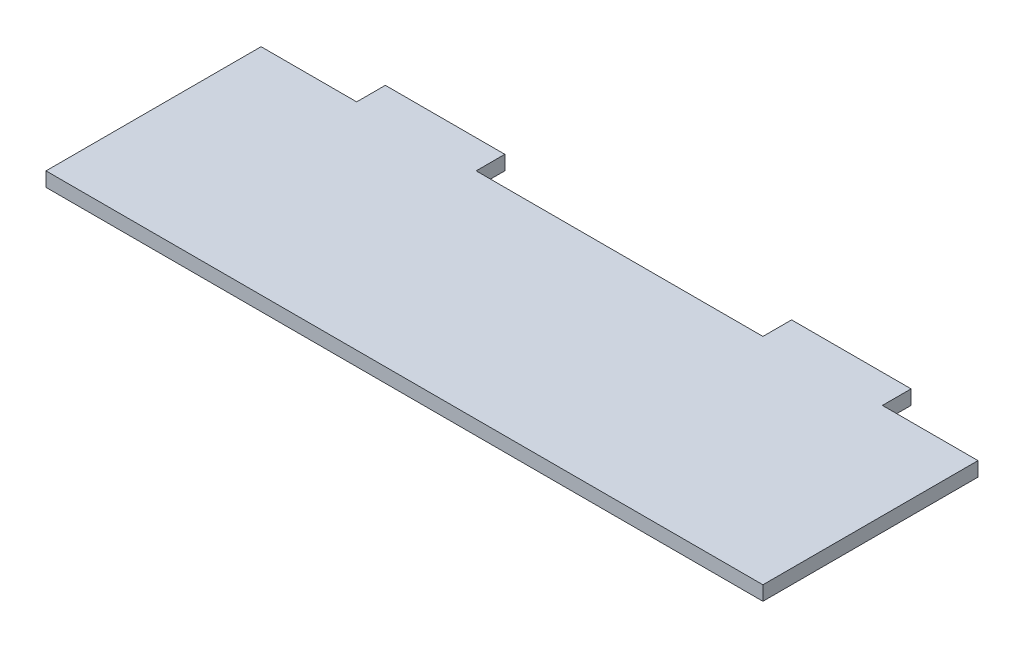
ISO-10303-21;
HEADER;
FILE_DESCRIPTION(('STEP AP214'),'2;1');
FILE_NAME('part.step','',(''),(''),'','','');
FILE_SCHEMA(('AUTOMOTIVE_DESIGN { 1 0 10303 214 1 1 1 1 }'));
ENDSEC;
DATA;
#1=APPLICATION_CONTEXT('core data for automotive mechanical design processes');
#2=APPLICATION_PROTOCOL_DEFINITION('international standard','automotive_design',2000,#1);
#3=PRODUCT_CONTEXT('',#1,'mechanical');
#4=PRODUCT('Part','Part','',(#3));
#5=PRODUCT_RELATED_PRODUCT_CATEGORY('part','',(#4));
#6=PRODUCT_DEFINITION_FORMATION('','',#4);
#7=PRODUCT_DEFINITION_CONTEXT('part definition',#1,'design');
#8=PRODUCT_DEFINITION('design','',#6,#7);
#9=PRODUCT_DEFINITION_SHAPE('','',#8);
#10=(LENGTH_UNIT() NAMED_UNIT(*) SI_UNIT(.MILLI.,.METRE.));
#11=(NAMED_UNIT(*) PLANE_ANGLE_UNIT() SI_UNIT($,.RADIAN.));
#12=(NAMED_UNIT(*) SI_UNIT($,.STERADIAN.) SOLID_ANGLE_UNIT());
#13=UNCERTAINTY_MEASURE_WITH_UNIT(LENGTH_MEASURE(1.E-05),#10,'distance_accuracy_value','');
#14=(GEOMETRIC_REPRESENTATION_CONTEXT(3) GLOBAL_UNCERTAINTY_ASSIGNED_CONTEXT((#13)) GLOBAL_UNIT_ASSIGNED_CONTEXT((#10,
#11,#12)) REPRESENTATION_CONTEXT('',''));
#15=CARTESIAN_POINT('',(0.,0.,0.));
#16=DIRECTION('',(0.,0.,1.));
#17=DIRECTION('',(1.,0.,0.));
#18=AXIS2_PLACEMENT_3D('',#15,#16,#17);
#19=CARTESIAN_POINT('',(75.,3.,-22.5));
#20=DIRECTION('',(-1.,0.,0.));
#21=DIRECTION('',(0.,0.,1.));
#22=AXIS2_PLACEMENT_3D('',#19,#20,#21);
#23=PLANE('',#22);
#24=DIRECTION('',(0.,0.,-1.));
#25=VECTOR('',#24,1.);
#26=CARTESIAN_POINT('',(75.,0.,-22.5));
#27=LINE('',#26,#25);
#28=CARTESIAN_POINT('',(75.,0.,22.5));
#29=VERTEX_POINT('',#28);
#30=CARTESIAN_POINT('',(75.,0.,-22.5));
#31=VERTEX_POINT('',#30);
#32=EDGE_CURVE('E155',#29,#31,#27,.T.);
#33=ORIENTED_EDGE('',*,*,#32,.T.);
#34=DIRECTION('',(0.,-1.,0.));
#35=VECTOR('',#34,1.);
#36=CARTESIAN_POINT('',(75.,3.,-22.5));
#37=LINE('',#36,#35);
#38=CARTESIAN_POINT('',(75.,3.,-22.5));
#39=VERTEX_POINT('',#38);
#40=EDGE_CURVE('E11',#39,#31,#37,.T.);
#41=ORIENTED_EDGE('',*,*,#40,.F.);
#42=DIRECTION('',(0.,0.,-1.));
#43=VECTOR('',#42,1.);
#44=CARTESIAN_POINT('',(75.,3.,-22.5));
#45=LINE('',#44,#43);
#46=CARTESIAN_POINT('',(75.,3.,22.5));
#47=VERTEX_POINT('',#46);
#48=EDGE_CURVE('E177',#47,#39,#45,.T.);
#49=ORIENTED_EDGE('',*,*,#48,.F.);
#50=DIRECTION('',(0.,-1.,0.));
#51=VECTOR('',#50,1.);
#52=CARTESIAN_POINT('',(75.,3.,22.5));
#53=LINE('',#52,#51);
#54=EDGE_CURVE('E151',#47,#29,#53,.T.);
#55=ORIENTED_EDGE('',*,*,#54,.T.);
#56=EDGE_LOOP('',(#33,#41,#49,#55));
#57=FACE_BOUND('',#56,.T.);
#58=ADVANCED_FACE('F35',(#57),#23,.F.);
#59=CARTESIAN_POINT('',(55.,3.,-22.5));
#60=DIRECTION('',(0.,0.,1.));
#61=DIRECTION('',(1.,0.,0.));
#62=AXIS2_PLACEMENT_3D('',#59,#60,#61);
#63=PLANE('',#62);
#64=DIRECTION('',(-1.,0.,0.));
#65=VECTOR('',#64,1.);
#66=CARTESIAN_POINT('',(55.,0.,-22.5));
#67=LINE('',#66,#65);
#68=CARTESIAN_POINT('',(55.,0.,-22.5));
#69=VERTEX_POINT('',#68);
#70=EDGE_CURVE('E158',#31,#69,#67,.T.);
#71=ORIENTED_EDGE('',*,*,#70,.T.);
#72=DIRECTION('',(0.,-1.,0.));
#73=VECTOR('',#72,1.);
#74=CARTESIAN_POINT('',(55.,3.,-22.5));
#75=LINE('',#74,#73);
#76=CARTESIAN_POINT('',(55.,3.,-22.5));
#77=VERTEX_POINT('',#76);
#78=EDGE_CURVE('E43',#77,#69,#75,.T.);
#79=ORIENTED_EDGE('',*,*,#78,.F.);
#80=DIRECTION('',(-1.,0.,0.));
#81=VECTOR('',#80,1.);
#82=CARTESIAN_POINT('',(55.,3.,-22.5));
#83=LINE('',#82,#81);
#84=EDGE_CURVE('E106',#39,#77,#83,.T.);
#85=ORIENTED_EDGE('',*,*,#84,.F.);
#86=ORIENTED_EDGE('',*,*,#40,.T.);
#87=EDGE_LOOP('',(#71,#79,#85,#86));
#88=FACE_BOUND('',#87,.T.);
#89=ADVANCED_FACE('F255',(#88),#63,.F.);
#90=CARTESIAN_POINT('',(55.,3.,-22.5));
#91=DIRECTION('',(-1.,0.,0.));
#92=DIRECTION('',(0.,0.,1.));
#93=AXIS2_PLACEMENT_3D('',#90,#91,#92);
#94=PLANE('',#93);
#95=DIRECTION('',(0.,0.,-1.));
#96=VECTOR('',#95,1.);
#97=CARTESIAN_POINT('',(55.,0.,-22.5));
#98=LINE('',#97,#96);
#99=CARTESIAN_POINT('',(55.,0.,-28.5));
#100=VERTEX_POINT('',#99);
#101=EDGE_CURVE('E160',#69,#100,#98,.T.);
#102=ORIENTED_EDGE('',*,*,#101,.T.);
#103=DIRECTION('',(0.,-1.,0.));
#104=VECTOR('',#103,1.);
#105=CARTESIAN_POINT('',(55.,3.,-28.5));
#106=LINE('',#105,#104);
#107=CARTESIAN_POINT('',(55.,3.,-28.5));
#108=VERTEX_POINT('',#107);
#109=EDGE_CURVE('E196',#108,#100,#106,.T.);
#110=ORIENTED_EDGE('',*,*,#109,.F.);
#111=DIRECTION('',(0.,0.,-1.));
#112=VECTOR('',#111,1.);
#113=CARTESIAN_POINT('',(55.,3.,-22.5));
#114=LINE('',#113,#112);
#115=EDGE_CURVE('E204',#77,#108,#114,.T.);
#116=ORIENTED_EDGE('',*,*,#115,.F.);
#117=ORIENTED_EDGE('',*,*,#78,.T.);
#118=EDGE_LOOP('',(#102,#110,#116,#117));
#119=FACE_BOUND('',#118,.T.);
#120=ADVANCED_FACE('F202',(#119),#94,.F.);
#121=CARTESIAN_POINT('',(55.,3.,-28.5));
#122=DIRECTION('',(0.,0.,1.));
#123=DIRECTION('',(1.,0.,0.));
#124=AXIS2_PLACEMENT_3D('',#121,#122,#123);
#125=PLANE('',#124);
#126=DIRECTION('',(-1.,0.,0.));
#127=VECTOR('',#126,1.);
#128=CARTESIAN_POINT('',(55.,0.,-28.5));
#129=LINE('',#128,#127);
#130=CARTESIAN_POINT('',(30.,0.,-28.5));
#131=VERTEX_POINT('',#130);
#132=EDGE_CURVE('E162',#100,#131,#129,.T.);
#133=ORIENTED_EDGE('',*,*,#132,.T.);
#134=DIRECTION('',(0.,-1.,0.));
#135=VECTOR('',#134,1.);
#136=CARTESIAN_POINT('',(30.,3.,-28.5));
#137=LINE('',#136,#135);
#138=CARTESIAN_POINT('',(30.,3.,-28.5));
#139=VERTEX_POINT('',#138);
#140=EDGE_CURVE('E193',#139,#131,#137,.T.);
#141=ORIENTED_EDGE('',*,*,#140,.F.);
#142=DIRECTION('',(-1.,0.,0.));
#143=VECTOR('',#142,1.);
#144=CARTESIAN_POINT('',(55.,3.,-28.5));
#145=LINE('',#144,#143);
#146=EDGE_CURVE('E222',#108,#139,#145,.T.);
#147=ORIENTED_EDGE('',*,*,#146,.F.);
#148=ORIENTED_EDGE('',*,*,#109,.T.);
#149=EDGE_LOOP('',(#133,#141,#147,#148));
#150=FACE_BOUND('',#149,.T.);
#151=ADVANCED_FACE('F213',(#150),#125,.F.);
#152=CARTESIAN_POINT('',(30.,3.,-22.5));
#153=DIRECTION('',(1.,0.,0.));
#154=DIRECTION('',(0.,0.,-1.));
#155=AXIS2_PLACEMENT_3D('',#152,#153,#154);
#156=PLANE('',#155);
#157=DIRECTION('',(0.,0.,1.));
#158=VECTOR('',#157,1.);
#159=CARTESIAN_POINT('',(30.,0.,-22.5));
#160=LINE('',#159,#158);
#161=CARTESIAN_POINT('',(30.,0.,-22.5));
#162=VERTEX_POINT('',#161);
#163=EDGE_CURVE('E164',#131,#162,#160,.T.);
#164=ORIENTED_EDGE('',*,*,#163,.T.);
#165=DIRECTION('',(0.,-1.,0.));
#166=VECTOR('',#165,1.);
#167=CARTESIAN_POINT('',(30.,3.,-22.5));
#168=LINE('',#167,#166);
#169=CARTESIAN_POINT('',(30.,3.,-22.5));
#170=VERTEX_POINT('',#169);
#171=EDGE_CURVE('E190',#170,#162,#168,.T.);
#172=ORIENTED_EDGE('',*,*,#171,.F.);
#173=DIRECTION('',(0.,0.,1.));
#174=VECTOR('',#173,1.);
#175=CARTESIAN_POINT('',(30.,3.,-22.5));
#176=LINE('',#175,#174);
#177=EDGE_CURVE('E219',#139,#170,#176,.T.);
#178=ORIENTED_EDGE('',*,*,#177,.F.);
#179=ORIENTED_EDGE('',*,*,#140,.T.);
#180=EDGE_LOOP('',(#164,#172,#178,#179));
#181=FACE_BOUND('',#180,.T.);
#182=ADVANCED_FACE('F217',(#181),#156,.F.);
#183=CARTESIAN_POINT('',(-30.,3.,-22.5));
#184=DIRECTION('',(0.,0.,1.));
#185=DIRECTION('',(1.,0.,0.));
#186=AXIS2_PLACEMENT_3D('',#183,#184,#185);
#187=PLANE('',#186);
#188=DIRECTION('',(-1.,0.,0.));
#189=VECTOR('',#188,1.);
#190=CARTESIAN_POINT('',(-30.,0.,-22.5));
#191=LINE('',#190,#189);
#192=CARTESIAN_POINT('',(-30.,0.,-22.5));
#193=VERTEX_POINT('',#192);
#194=EDGE_CURVE('E166',#162,#193,#191,.T.);
#195=ORIENTED_EDGE('',*,*,#194,.T.);
#196=DIRECTION('',(0.,-1.,0.));
#197=VECTOR('',#196,1.);
#198=CARTESIAN_POINT('',(-30.,3.,-22.5));
#199=LINE('',#198,#197);
#200=CARTESIAN_POINT('',(-30.,3.,-22.5));
#201=VERTEX_POINT('',#200);
#202=EDGE_CURVE('E187',#201,#193,#199,.T.);
#203=ORIENTED_EDGE('',*,*,#202,.F.);
#204=DIRECTION('',(-1.,0.,0.));
#205=VECTOR('',#204,1.);
#206=CARTESIAN_POINT('',(-30.,3.,-22.5));
#207=LINE('',#206,#205);
#208=EDGE_CURVE('E221',#170,#201,#207,.T.);
#209=ORIENTED_EDGE('',*,*,#208,.F.);
#210=ORIENTED_EDGE('',*,*,#171,.T.);
#211=EDGE_LOOP('',(#195,#203,#209,#210));
#212=FACE_BOUND('',#211,.T.);
#213=ADVANCED_FACE('F268',(#212),#187,.F.);
#214=CARTESIAN_POINT('',(-30.,3.,-22.5));
#215=DIRECTION('',(-1.,0.,0.));
#216=DIRECTION('',(0.,0.,1.));
#217=AXIS2_PLACEMENT_3D('',#214,#215,#216);
#218=PLANE('',#217);
#219=DIRECTION('',(0.,0.,-1.));
#220=VECTOR('',#219,1.);
#221=CARTESIAN_POINT('',(-30.,0.,-22.5));
#222=LINE('',#221,#220);
#223=CARTESIAN_POINT('',(-30.,0.,-28.5));
#224=VERTEX_POINT('',#223);
#225=EDGE_CURVE('E168',#193,#224,#222,.T.);
#226=ORIENTED_EDGE('',*,*,#225,.T.);
#227=DIRECTION('',(0.,-1.,0.));
#228=VECTOR('',#227,1.);
#229=CARTESIAN_POINT('',(-30.,3.,-28.5));
#230=LINE('',#229,#228);
#231=CARTESIAN_POINT('',(-30.,3.,-28.5));
#232=VERTEX_POINT('',#231);
#233=EDGE_CURVE('E184',#232,#224,#230,.T.);
#234=ORIENTED_EDGE('',*,*,#233,.F.);
#235=DIRECTION('',(0.,0.,-1.));
#236=VECTOR('',#235,1.);
#237=CARTESIAN_POINT('',(-30.,3.,-22.5));
#238=LINE('',#237,#236);
#239=EDGE_CURVE('E224',#201,#232,#238,.T.);
#240=ORIENTED_EDGE('',*,*,#239,.F.);
#241=ORIENTED_EDGE('',*,*,#202,.T.);
#242=EDGE_LOOP('',(#226,#234,#240,#241));
#243=FACE_BOUND('',#242,.T.);
#244=ADVANCED_FACE('F271',(#243),#218,.F.);
#245=CARTESIAN_POINT('',(-55.,3.,-28.5));
#246=DIRECTION('',(0.,0.,1.));
#247=DIRECTION('',(1.,0.,0.));
#248=AXIS2_PLACEMENT_3D('',#245,#246,#247);
#249=PLANE('',#248);
#250=DIRECTION('',(-1.,0.,0.));
#251=VECTOR('',#250,1.);
#252=CARTESIAN_POINT('',(-55.,0.,-28.5));
#253=LINE('',#252,#251);
#254=CARTESIAN_POINT('',(-55.,0.,-28.5));
#255=VERTEX_POINT('',#254);
#256=EDGE_CURVE('E170',#224,#255,#253,.T.);
#257=ORIENTED_EDGE('',*,*,#256,.T.);
#258=DIRECTION('',(0.,-1.,0.));
#259=VECTOR('',#258,1.);
#260=CARTESIAN_POINT('',(-55.,3.,-28.5));
#261=LINE('',#260,#259);
#262=CARTESIAN_POINT('',(-55.,3.,-28.5));
#263=VERTEX_POINT('',#262);
#264=EDGE_CURVE('E181',#263,#255,#261,.T.);
#265=ORIENTED_EDGE('',*,*,#264,.F.);
#266=DIRECTION('',(-1.,0.,0.));
#267=VECTOR('',#266,1.);
#268=CARTESIAN_POINT('',(-55.,3.,-28.5));
#269=LINE('',#268,#267);
#270=EDGE_CURVE('E230',#232,#263,#269,.T.);
#271=ORIENTED_EDGE('',*,*,#270,.F.);
#272=ORIENTED_EDGE('',*,*,#233,.T.);
#273=EDGE_LOOP('',(#257,#265,#271,#272));
#274=FACE_BOUND('',#273,.T.);
#275=ADVANCED_FACE('F236',(#274),#249,.F.);
#276=CARTESIAN_POINT('',(-55.,3.,-22.5));
#277=DIRECTION('',(1.,0.,0.));
#278=DIRECTION('',(0.,0.,-1.));
#279=AXIS2_PLACEMENT_3D('',#276,#277,#278);
#280=PLANE('',#279);
#281=DIRECTION('',(0.,0.,1.));
#282=VECTOR('',#281,1.);
#283=CARTESIAN_POINT('',(-55.,0.,-22.5));
#284=LINE('',#283,#282);
#285=CARTESIAN_POINT('',(-55.,0.,-22.5));
#286=VERTEX_POINT('',#285);
#287=EDGE_CURVE('E172',#255,#286,#284,.T.);
#288=ORIENTED_EDGE('',*,*,#287,.T.);
#289=DIRECTION('',(0.,-1.,0.));
#290=VECTOR('',#289,1.);
#291=CARTESIAN_POINT('',(-55.,3.,-22.5));
#292=LINE('',#291,#290);
#293=CARTESIAN_POINT('',(-55.,3.,-22.5));
#294=VERTEX_POINT('',#293);
#295=EDGE_CURVE('E146',#294,#286,#292,.T.);
#296=ORIENTED_EDGE('',*,*,#295,.F.);
#297=DIRECTION('',(0.,0.,1.));
#298=VECTOR('',#297,1.);
#299=CARTESIAN_POINT('',(-55.,3.,-22.5));
#300=LINE('',#299,#298);
#301=EDGE_CURVE('E137',#263,#294,#300,.T.);
#302=ORIENTED_EDGE('',*,*,#301,.F.);
#303=ORIENTED_EDGE('',*,*,#264,.T.);
#304=EDGE_LOOP('',(#288,#296,#302,#303));
#305=FACE_BOUND('',#304,.T.);
#306=ADVANCED_FACE('F240',(#305),#280,.F.);
#307=CARTESIAN_POINT('',(-75.,3.,-22.5));
#308=DIRECTION('',(0.,0.,1.));
#309=DIRECTION('',(1.,0.,0.));
#310=AXIS2_PLACEMENT_3D('',#307,#308,#309);
#311=PLANE('',#310);
#312=DIRECTION('',(-1.,0.,0.));
#313=VECTOR('',#312,1.);
#314=CARTESIAN_POINT('',(-75.,0.,-22.5));
#315=LINE('',#314,#313);
#316=CARTESIAN_POINT('',(-75.,0.,-22.5));
#317=VERTEX_POINT('',#316);
#318=EDGE_CURVE('E145',#286,#317,#315,.T.);
#319=ORIENTED_EDGE('',*,*,#318,.T.);
#320=DIRECTION('',(0.,-1.,0.));
#321=VECTOR('',#320,1.);
#322=CARTESIAN_POINT('',(-75.,3.,-22.5));
#323=LINE('',#322,#321);
#324=CARTESIAN_POINT('',(-75.,3.,-22.5));
#325=VERTEX_POINT('',#324);
#326=EDGE_CURVE('E142',#325,#317,#323,.T.);
#327=ORIENTED_EDGE('',*,*,#326,.F.);
#328=DIRECTION('',(-1.,0.,0.));
#329=VECTOR('',#328,1.);
#330=CARTESIAN_POINT('',(-75.,3.,-22.5));
#331=LINE('',#330,#329);
#332=EDGE_CURVE('E131',#294,#325,#331,.T.);
#333=ORIENTED_EDGE('',*,*,#332,.F.);
#334=ORIENTED_EDGE('',*,*,#295,.T.);
#335=EDGE_LOOP('',(#319,#327,#333,#334));
#336=FACE_BOUND('',#335,.T.);
#337=ADVANCED_FACE('F143',(#336),#311,.F.);
#338=CARTESIAN_POINT('',(-75.,3.,-22.5));
#339=DIRECTION('',(1.,0.,0.));
#340=DIRECTION('',(0.,0.,-1.));
#341=AXIS2_PLACEMENT_3D('',#338,#339,#340);
#342=PLANE('',#341);
#343=DIRECTION('',(0.,0.,1.));
#344=VECTOR('',#343,1.);
#345=CARTESIAN_POINT('',(-75.,0.,-22.5));
#346=LINE('',#345,#344);
#347=CARTESIAN_POINT('',(-75.,0.,22.5));
#348=VERTEX_POINT('',#347);
#349=EDGE_CURVE('E92',#317,#348,#346,.T.);
#350=ORIENTED_EDGE('',*,*,#349,.T.);
#351=DIRECTION('',(0.,-1.,0.));
#352=VECTOR('',#351,1.);
#353=CARTESIAN_POINT('',(-75.,3.,22.5));
#354=LINE('',#353,#352);
#355=CARTESIAN_POINT('',(-75.,3.,22.5));
#356=VERTEX_POINT('',#355);
#357=EDGE_CURVE('E147',#356,#348,#354,.T.);
#358=ORIENTED_EDGE('',*,*,#357,.F.);
#359=DIRECTION('',(0.,0.,1.));
#360=VECTOR('',#359,1.);
#361=CARTESIAN_POINT('',(-75.,3.,-22.5));
#362=LINE('',#361,#360);
#363=EDGE_CURVE('E135',#325,#356,#362,.T.);
#364=ORIENTED_EDGE('',*,*,#363,.F.);
#365=ORIENTED_EDGE('',*,*,#326,.T.);
#366=EDGE_LOOP('',(#350,#358,#364,#365));
#367=FACE_BOUND('',#366,.T.);
#368=ADVANCED_FACE('F149',(#367),#342,.F.);
#369=CARTESIAN_POINT('',(-75.,3.,22.5));
#370=DIRECTION('',(0.,0.,-1.));
#371=DIRECTION('',(-1.,0.,0.));
#372=AXIS2_PLACEMENT_3D('',#369,#370,#371);
#373=PLANE('',#372);
#374=DIRECTION('',(1.,0.,0.));
#375=VECTOR('',#374,1.);
#376=CARTESIAN_POINT('',(-75.,0.,22.5));
#377=LINE('',#376,#375);
#378=EDGE_CURVE('E98',#348,#29,#377,.T.);
#379=ORIENTED_EDGE('',*,*,#378,.T.);
#380=ORIENTED_EDGE('',*,*,#54,.F.);
#381=DIRECTION('',(1.,0.,0.));
#382=VECTOR('',#381,1.);
#383=CARTESIAN_POINT('',(-75.,3.,22.5));
#384=LINE('',#383,#382);
#385=EDGE_CURVE('E51',#356,#47,#384,.T.);
#386=ORIENTED_EDGE('',*,*,#385,.F.);
#387=ORIENTED_EDGE('',*,*,#357,.T.);
#388=EDGE_LOOP('',(#379,#380,#386,#387));
#389=FACE_BOUND('',#388,.T.);
#390=ADVANCED_FACE('F244',(#389),#373,.F.);
#391=CARTESIAN_POINT('',(0.,3.,0.));
#392=DIRECTION('',(0.,1.,0.));
#393=DIRECTION('',(0.,0.,1.));
#394=AXIS2_PLACEMENT_3D('',#391,#392,#393);
#395=PLANE('',#394);
#396=ORIENTED_EDGE('',*,*,#48,.T.);
#397=ORIENTED_EDGE('',*,*,#84,.T.);
#398=ORIENTED_EDGE('',*,*,#115,.T.);
#399=ORIENTED_EDGE('',*,*,#146,.T.);
#400=ORIENTED_EDGE('',*,*,#177,.T.);
#401=ORIENTED_EDGE('',*,*,#208,.T.);
#402=ORIENTED_EDGE('',*,*,#239,.T.);
#403=ORIENTED_EDGE('',*,*,#270,.T.);
#404=ORIENTED_EDGE('',*,*,#301,.T.);
#405=ORIENTED_EDGE('',*,*,#332,.T.);
#406=ORIENTED_EDGE('',*,*,#363,.T.);
#407=ORIENTED_EDGE('',*,*,#385,.T.);
#408=EDGE_LOOP('',(#396,#397,#398,#399,#400,#401,#402,#403,#404,#405,#406,#407));
#409=FACE_BOUND('',#408,.T.);
#410=ADVANCED_FACE('F133',(#409),#395,.T.);
#411=CARTESIAN_POINT('',(0.,0.,0.));
#412=DIRECTION('',(0.,1.,0.));
#413=DIRECTION('',(0.,0.,1.));
#414=AXIS2_PLACEMENT_3D('',#411,#412,#413);
#415=PLANE('',#414);
#416=ORIENTED_EDGE('',*,*,#32,.F.);
#417=ORIENTED_EDGE('',*,*,#378,.F.);
#418=ORIENTED_EDGE('',*,*,#349,.F.);
#419=ORIENTED_EDGE('',*,*,#318,.F.);
#420=ORIENTED_EDGE('',*,*,#287,.F.);
#421=ORIENTED_EDGE('',*,*,#256,.F.);
#422=ORIENTED_EDGE('',*,*,#225,.F.);
#423=ORIENTED_EDGE('',*,*,#194,.F.);
#424=ORIENTED_EDGE('',*,*,#163,.F.);
#425=ORIENTED_EDGE('',*,*,#132,.F.);
#426=ORIENTED_EDGE('',*,*,#101,.F.);
#427=ORIENTED_EDGE('',*,*,#70,.F.);
#428=EDGE_LOOP('',(#416,#417,#418,#419,#420,#421,#422,#423,#424,#425,#426,#427));
#429=FACE_BOUND('',#428,.T.);
#430=ADVANCED_FACE('F208',(#429),#415,.F.);
#431=CLOSED_SHELL('',(#58,#89,#120,#151,#182,#213,#244,#275,#306,#337,#368,#390,#410,#430));
#432=MANIFOLD_SOLID_BREP('B2',#431);
#433=ADVANCED_BREP_SHAPE_REPRESENTATION('',(#18,#432),#14);
#434=SHAPE_DEFINITION_REPRESENTATION(#9,#433);
ENDSEC;
END-ISO-10303-21;
